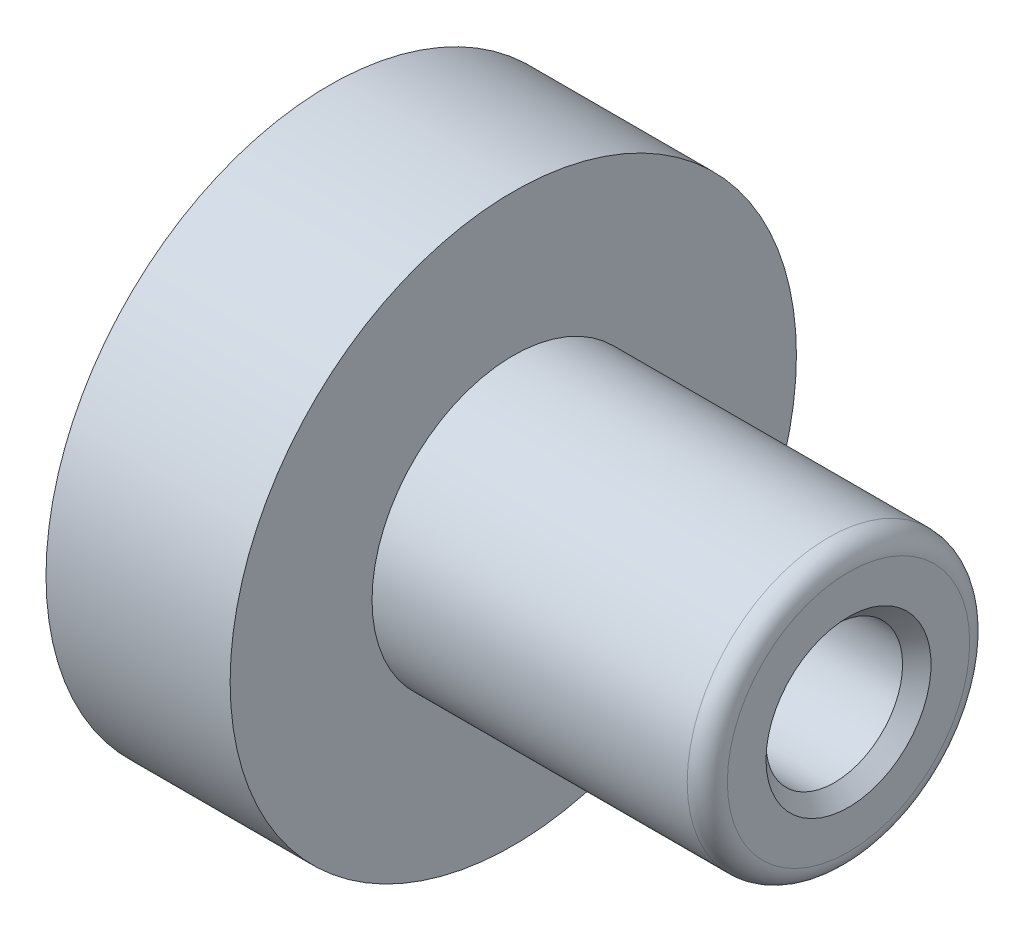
ISO-10303-21;
HEADER;
FILE_DESCRIPTION(('STEP AP214'),'2;1');
FILE_NAME('part.step','',(''),(''),'','','');
FILE_SCHEMA(('AUTOMOTIVE_DESIGN { 1 0 10303 214 1 1 1 1 }'));
ENDSEC;
DATA;
#1=APPLICATION_CONTEXT('core data for automotive mechanical design processes');
#2=APPLICATION_PROTOCOL_DEFINITION('international standard','automotive_design',2000,#1);
#3=PRODUCT_CONTEXT('',#1,'mechanical');
#4=PRODUCT('Part','Part','',(#3));
#5=PRODUCT_RELATED_PRODUCT_CATEGORY('part','',(#4));
#6=PRODUCT_DEFINITION_FORMATION('','',#4);
#7=PRODUCT_DEFINITION_CONTEXT('part definition',#1,'design');
#8=PRODUCT_DEFINITION('design','',#6,#7);
#9=PRODUCT_DEFINITION_SHAPE('','',#8);
#10=(LENGTH_UNIT() NAMED_UNIT(*) SI_UNIT(.MILLI.,.METRE.));
#11=(NAMED_UNIT(*) PLANE_ANGLE_UNIT() SI_UNIT($,.RADIAN.));
#12=(NAMED_UNIT(*) SI_UNIT($,.STERADIAN.) SOLID_ANGLE_UNIT());
#13=UNCERTAINTY_MEASURE_WITH_UNIT(LENGTH_MEASURE(1.E-05),#10,'distance_accuracy_value','');
#14=(GEOMETRIC_REPRESENTATION_CONTEXT(3) GLOBAL_UNCERTAINTY_ASSIGNED_CONTEXT((#13)) GLOBAL_UNIT_ASSIGNED_CONTEXT((#10,
#11,#12)) REPRESENTATION_CONTEXT('',''));
#15=CARTESIAN_POINT('',(0.,0.,0.));
#16=DIRECTION('',(0.,0.,1.));
#17=DIRECTION('',(1.,0.,0.));
#18=AXIS2_PLACEMENT_3D('',#15,#16,#17);
#19=CARTESIAN_POINT('',(0.,0.,0.));
#20=DIRECTION('',(-1.,0.,0.));
#21=DIRECTION('',(0.,0.,1.));
#22=AXIS2_PLACEMENT_3D('',#19,#20,#21);
#23=CYLINDRICAL_SURFACE('',#22,8.128);
#24=CARTESIAN_POINT('',(28.067,0.,0.));
#25=DIRECTION('',(-1.,0.,0.));
#26=DIRECTION('',(0.,0.,1.));
#27=AXIS2_PLACEMENT_3D('',#24,#25,#26);
#28=CIRCLE('',#27,8.128);
#29=CARTESIAN_POINT('',(28.067,0.,8.128));
#30=VERTEX_POINT('',#29);
#31=EDGE_CURVE('E42',#30,#30,#28,.T.);
#32=ORIENTED_EDGE('',*,*,#31,.F.);
#33=EDGE_LOOP('',(#32));
#34=FACE_BOUND('',#33,.T.);
#35=CARTESIAN_POINT('',(0.,0.,0.));
#36=DIRECTION('',(-1.,0.,0.));
#37=DIRECTION('',(0.,0.,1.));
#38=AXIS2_PLACEMENT_3D('',#35,#36,#37);
#39=CIRCLE('',#38,8.128);
#40=CARTESIAN_POINT('',(0.,0.,8.128));
#41=VERTEX_POINT('',#40);
#42=EDGE_CURVE('E63',#41,#41,#39,.T.);
#43=ORIENTED_EDGE('',*,*,#42,.T.);
#44=EDGE_LOOP('',(#43));
#45=FACE_BOUND('',#44,.T.);
#46=ADVANCED_FACE('F31',(#34,#45),#23,.F.);
#47=CARTESIAN_POINT('',(28.067,8.128,0.));
#48=DIRECTION('',(1.,0.,0.));
#49=DIRECTION('',(0.,0.,-1.));
#50=AXIS2_PLACEMENT_3D('',#47,#48,#49);
#51=PLANE('',#50);
#52=CARTESIAN_POINT('',(28.067,0.,0.));
#53=DIRECTION('',(1.,0.,0.));
#54=DIRECTION('',(0.,0.,-1.));
#55=AXIS2_PLACEMENT_3D('',#52,#53,#54);
#56=CIRCLE('',#55,5.3594);
#57=CARTESIAN_POINT('',(28.067,0.,-5.3594));
#58=VERTEX_POINT('',#57);
#59=EDGE_CURVE('E76',#58,#58,#56,.T.);
#60=ORIENTED_EDGE('',*,*,#59,.T.);
#61=EDGE_LOOP('',(#60));
#62=FACE_BOUND('',#61,.T.);
#63=ORIENTED_EDGE('',*,*,#31,.T.);
#64=EDGE_LOOP('',(#63));
#65=FACE_BOUND('',#64,.T.);
#66=ADVANCED_FACE('F82',(#62,#65),#51,.F.);
#67=CARTESIAN_POINT('',(40.767,9.5123,0.));
#68=DIRECTION('',(-1.,0.,0.));
#69=DIRECTION('',(0.,0.,1.));
#70=AXIS2_PLACEMENT_3D('',#67,#68,#69);
#71=PLANE('',#70);
#72=CARTESIAN_POINT('',(40.767,0.,0.));
#73=DIRECTION('',(-1.,0.,0.));
#74=DIRECTION('',(0.,0.,1.));
#75=AXIS2_PLACEMENT_3D('',#72,#73,#74);
#76=CIRCLE('',#75,6.47699999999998);
#77=CARTESIAN_POINT('',(40.767,0.,6.47699999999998));
#78=VERTEX_POINT('',#77);
#79=EDGE_CURVE('E10',#78,#78,#76,.T.);
#80=ORIENTED_EDGE('',*,*,#79,.T.);
#81=EDGE_LOOP('',(#80));
#82=FACE_BOUND('',#81,.T.);
#83=CARTESIAN_POINT('',(40.767,0.,0.));
#84=DIRECTION('',(-1.,0.,0.));
#85=DIRECTION('',(0.,0.,1.));
#86=AXIS2_PLACEMENT_3D('',#83,#84,#85);
#87=CIRCLE('',#86,9.5123);
#88=CARTESIAN_POINT('',(40.767,0.,9.5123));
#89=VERTEX_POINT('',#88);
#90=EDGE_CURVE('E46',#89,#89,#87,.T.);
#91=ORIENTED_EDGE('',*,*,#90,.F.);
#92=EDGE_LOOP('',(#91));
#93=FACE_BOUND('',#92,.T.);
#94=ADVANCED_FACE('F102',(#82,#93),#71,.F.);
#95=CARTESIAN_POINT('',(39.1922,0.,0.));
#96=DIRECTION('',(-1.,0.,0.));
#97=DIRECTION('',(0.,0.,1.));
#98=AXIS2_PLACEMENT_3D('',#95,#96,#97);
#99=TOROIDAL_SURFACE('',#98,9.5123,1.5748);
#100=CARTESIAN_POINT('',(39.1922,0.,0.));
#101=DIRECTION('',(-1.,0.,0.));
#102=DIRECTION('',(0.,0.,1.));
#103=AXIS2_PLACEMENT_3D('',#100,#101,#102);
#104=CIRCLE('',#103,11.0871);
#105=CARTESIAN_POINT('',(39.1922,0.,11.0871));
#106=VERTEX_POINT('',#105);
#107=EDGE_CURVE('E51',#106,#106,#104,.T.);
#108=ORIENTED_EDGE('',*,*,#107,.F.);
#109=EDGE_LOOP('',(#108));
#110=FACE_BOUND('',#109,.T.);
#111=ORIENTED_EDGE('',*,*,#90,.T.);
#112=EDGE_LOOP('',(#111));
#113=FACE_BOUND('',#112,.T.);
#114=ADVANCED_FACE('F109',(#110,#113),#99,.T.);
#115=CARTESIAN_POINT('',(0.,0.,0.));
#116=DIRECTION('',(-1.,0.,0.));
#117=DIRECTION('',(0.,0.,1.));
#118=AXIS2_PLACEMENT_3D('',#115,#116,#117);
#119=CYLINDRICAL_SURFACE('',#118,11.0871);
#120=CARTESIAN_POINT('',(14.4526,0.,0.));
#121=DIRECTION('',(-1.,0.,0.));
#122=DIRECTION('',(0.,0.,1.));
#123=AXIS2_PLACEMENT_3D('',#120,#121,#122);
#124=CIRCLE('',#123,11.0871);
#125=CARTESIAN_POINT('',(14.4526,0.,11.0871));
#126=VERTEX_POINT('',#125);
#127=EDGE_CURVE('E54',#126,#126,#124,.T.);
#128=ORIENTED_EDGE('',*,*,#127,.F.);
#129=EDGE_LOOP('',(#128));
#130=FACE_BOUND('',#129,.T.);
#131=ORIENTED_EDGE('',*,*,#107,.T.);
#132=EDGE_LOOP('',(#131));
#133=FACE_BOUND('',#132,.T.);
#134=ADVANCED_FACE('F112',(#130,#133),#119,.T.);
#135=CARTESIAN_POINT('',(14.4526,22.225,0.));
#136=DIRECTION('',(-1.,0.,0.));
#137=DIRECTION('',(0.,0.,1.));
#138=AXIS2_PLACEMENT_3D('',#135,#136,#137);
#139=PLANE('',#138);
#140=CARTESIAN_POINT('',(14.4526,0.,0.));
#141=DIRECTION('',(-1.,0.,0.));
#142=DIRECTION('',(0.,0.,1.));
#143=AXIS2_PLACEMENT_3D('',#140,#141,#142);
#144=CIRCLE('',#143,22.225);
#145=CARTESIAN_POINT('',(14.4526,0.,22.225));
#146=VERTEX_POINT('',#145);
#147=EDGE_CURVE('E57',#146,#146,#144,.T.);
#148=ORIENTED_EDGE('',*,*,#147,.F.);
#149=EDGE_LOOP('',(#148));
#150=FACE_BOUND('',#149,.T.);
#151=ORIENTED_EDGE('',*,*,#127,.T.);
#152=EDGE_LOOP('',(#151));
#153=FACE_BOUND('',#152,.T.);
#154=ADVANCED_FACE('F116',(#150,#153),#139,.F.);
#155=CARTESIAN_POINT('',(0.,0.,0.));
#156=DIRECTION('',(-1.,0.,0.));
#157=DIRECTION('',(0.,0.,1.));
#158=AXIS2_PLACEMENT_3D('',#155,#156,#157);
#159=CYLINDRICAL_SURFACE('',#158,22.225);
#160=CARTESIAN_POINT('',(0.,0.,0.));
#161=DIRECTION('',(-1.,0.,0.));
#162=DIRECTION('',(0.,0.,1.));
#163=AXIS2_PLACEMENT_3D('',#160,#161,#162);
#164=CIRCLE('',#163,22.225);
#165=CARTESIAN_POINT('',(0.,0.,22.225));
#166=VERTEX_POINT('',#165);
#167=EDGE_CURVE('E60',#166,#166,#164,.T.);
#168=ORIENTED_EDGE('',*,*,#167,.F.);
#169=EDGE_LOOP('',(#168));
#170=FACE_BOUND('',#169,.T.);
#171=ORIENTED_EDGE('',*,*,#147,.T.);
#172=EDGE_LOOP('',(#171));
#173=FACE_BOUND('',#172,.T.);
#174=ADVANCED_FACE('F120',(#170,#173),#159,.T.);
#175=CARTESIAN_POINT('',(0.,8.128,0.));
#176=DIRECTION('',(1.,0.,0.));
#177=DIRECTION('',(0.,0.,-1.));
#178=AXIS2_PLACEMENT_3D('',#175,#176,#177);
#179=PLANE('',#178);
#180=CARTESIAN_POINT('',(0.,0.,12.7));
#181=DIRECTION('',(-1.,0.,0.));
#182=DIRECTION('',(0.,0.,-1.));
#183=AXIS2_PLACEMENT_3D('',#180,#181,#182);
#184=CIRCLE('',#183,3.2004);
#185=CARTESIAN_POINT('',(0.,0.,9.4996));
#186=VERTEX_POINT('',#185);
#187=EDGE_CURVE('E73',#186,#186,#184,.T.);
#188=ORIENTED_EDGE('',*,*,#187,.F.);
#189=EDGE_LOOP('',(#188));
#190=FACE_BOUND('',#189,.T.);
#191=CARTESIAN_POINT('',(0.,0.,-12.7));
#192=DIRECTION('',(-1.,0.,0.));
#193=DIRECTION('',(0.,0.,1.));
#194=AXIS2_PLACEMENT_3D('',#191,#192,#193);
#195=CIRCLE('',#194,3.2004);
#196=CARTESIAN_POINT('',(0.,0.,-9.4996));
#197=VERTEX_POINT('',#196);
#198=EDGE_CURVE('E67',#197,#197,#195,.T.);
#199=ORIENTED_EDGE('',*,*,#198,.F.);
#200=EDGE_LOOP('',(#199));
#201=FACE_BOUND('',#200,.T.);
#202=ORIENTED_EDGE('',*,*,#42,.F.);
#203=EDGE_LOOP('',(#202));
#204=FACE_BOUND('',#203,.T.);
#205=ORIENTED_EDGE('',*,*,#167,.T.);
#206=EDGE_LOOP('',(#205));
#207=FACE_BOUND('',#206,.T.);
#208=ADVANCED_FACE('F124',(#190,#201,#204,#207),#179,.F.);
#209=CARTESIAN_POINT('',(7.9502,0.,-12.7));
#210=DIRECTION('',(-1.,0.,0.));
#211=DIRECTION('',(0.,0.,1.));
#212=AXIS2_PLACEMENT_3D('',#209,#210,#211);
#213=CYLINDRICAL_SURFACE('',#212,3.2004);
#214=CARTESIAN_POINT('',(7.9502,0.,-12.7));
#215=DIRECTION('',(-1.,0.,0.));
#216=DIRECTION('',(0.,0.,1.));
#217=AXIS2_PLACEMENT_3D('',#214,#215,#216);
#218=CIRCLE('',#217,3.2004);
#219=CARTESIAN_POINT('',(7.9502,0.,-9.4996));
#220=VERTEX_POINT('',#219);
#221=EDGE_CURVE('E66',#220,#220,#218,.T.);
#222=ORIENTED_EDGE('',*,*,#221,.F.);
#223=EDGE_LOOP('',(#222));
#224=FACE_BOUND('',#223,.T.);
#225=ORIENTED_EDGE('',*,*,#198,.T.);
#226=EDGE_LOOP('',(#225));
#227=FACE_BOUND('',#226,.T.);
#228=ADVANCED_FACE('F128',(#224,#227),#213,.F.);
#229=CARTESIAN_POINT('',(7.9502,0.,-12.7));
#230=DIRECTION('',(-1.,0.,0.));
#231=DIRECTION('',(0.,0.,1.));
#232=AXIS2_PLACEMENT_3D('',#229,#230,#231);
#233=PLANE('',#232);
#234=ORIENTED_EDGE('',*,*,#221,.T.);
#235=EDGE_LOOP('',(#234));
#236=FACE_BOUND('',#235,.T.);
#237=ADVANCED_FACE('F132',(#236),#233,.T.);
#238=CARTESIAN_POINT('',(7.9502,0.,12.7));
#239=DIRECTION('',(-1.,0.,0.));
#240=DIRECTION('',(0.,0.,1.));
#241=AXIS2_PLACEMENT_3D('',#238,#239,#240);
#242=CYLINDRICAL_SURFACE('',#241,3.2004);
#243=CARTESIAN_POINT('',(7.9502,0.,12.7));
#244=DIRECTION('',(-1.,0.,0.));
#245=DIRECTION('',(0.,0.,-1.));
#246=AXIS2_PLACEMENT_3D('',#243,#244,#245);
#247=CIRCLE('',#246,3.2004);
#248=CARTESIAN_POINT('',(7.9502,0.,9.4996));
#249=VERTEX_POINT('',#248);
#250=EDGE_CURVE('E70',#249,#249,#247,.T.);
#251=ORIENTED_EDGE('',*,*,#250,.F.);
#252=EDGE_LOOP('',(#251));
#253=FACE_BOUND('',#252,.T.);
#254=ORIENTED_EDGE('',*,*,#187,.T.);
#255=EDGE_LOOP('',(#254));
#256=FACE_BOUND('',#255,.T.);
#257=ADVANCED_FACE('F94',(#253,#256),#242,.F.);
#258=CARTESIAN_POINT('',(7.9502,0.,12.7));
#259=DIRECTION('',(1.,0.,0.));
#260=DIRECTION('',(0.,0.,-1.));
#261=AXIS2_PLACEMENT_3D('',#258,#259,#260);
#262=PLANE('',#261);
#263=ORIENTED_EDGE('',*,*,#250,.T.);
#264=EDGE_LOOP('',(#263));
#265=FACE_BOUND('',#264,.T.);
#266=ADVANCED_FACE('F87',(#265),#262,.F.);
#267=CARTESIAN_POINT('',(0.,0.,0.));
#268=DIRECTION('',(1.,0.,0.));
#269=DIRECTION('',(0.,0.,-1.));
#270=AXIS2_PLACEMENT_3D('',#267,#268,#269);
#271=CYLINDRICAL_SURFACE('',#270,5.3594);
#272=CARTESIAN_POINT('',(39.6494,0.,0.));
#273=DIRECTION('',(-1.,0.,0.));
#274=DIRECTION('',(0.,0.,1.));
#275=AXIS2_PLACEMENT_3D('',#272,#273,#274);
#276=CIRCLE('',#275,5.3594);
#277=CARTESIAN_POINT('',(39.6494,0.,5.3594));
#278=VERTEX_POINT('',#277);
#279=EDGE_CURVE('E38',#278,#278,#276,.F.);
#280=ORIENTED_EDGE('',*,*,#279,.T.);
#281=EDGE_LOOP('',(#280));
#282=FACE_BOUND('',#281,.T.);
#283=ORIENTED_EDGE('',*,*,#59,.F.);
#284=EDGE_LOOP('',(#283));
#285=FACE_BOUND('',#284,.T.);
#286=ADVANCED_FACE('F85',(#282,#285),#271,.F.);
#287=CARTESIAN_POINT('',(39.6494,0.,0.));
#288=DIRECTION('',(1.,0.,0.));
#289=DIRECTION('',(0.,0.,-1.));
#290=AXIS2_PLACEMENT_3D('',#287,#288,#289);
#291=CONICAL_SURFACE('',#290,5.3594,0.785398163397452);
#292=ORIENTED_EDGE('',*,*,#79,.F.);
#293=EDGE_LOOP('',(#292));
#294=FACE_BOUND('',#293,.T.);
#295=ORIENTED_EDGE('',*,*,#279,.F.);
#296=EDGE_LOOP('',(#295));
#297=FACE_BOUND('',#296,.T.);
#298=ADVANCED_FACE('F33',(#294,#297),#291,.F.);
#299=CLOSED_SHELL('',(#46,#66,#94,#114,#134,#154,#174,#208,#228,#237,#257,#266,#286,#298));
#300=MANIFOLD_SOLID_BREP('B2',#299);
#301=ADVANCED_BREP_SHAPE_REPRESENTATION('',(#18,#300),#14);
#302=SHAPE_DEFINITION_REPRESENTATION(#9,#301);
ENDSEC;
END-ISO-10303-21;
